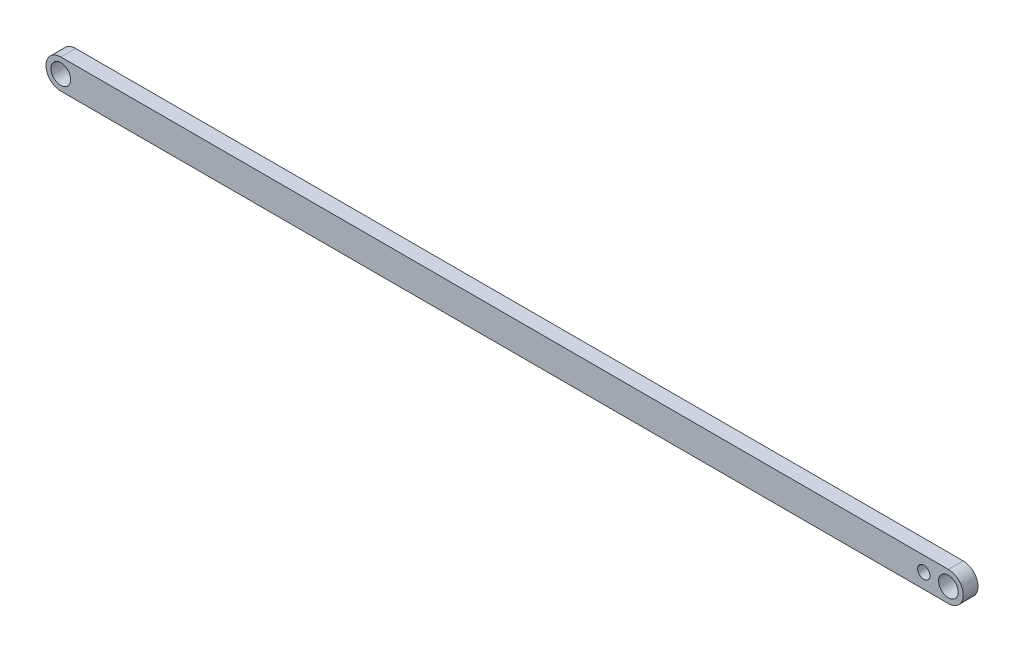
ISO-10303-21;
HEADER;
FILE_DESCRIPTION(('STEP AP214'),'2;1');
FILE_NAME('part.step','',(''),(''),'','','');
FILE_SCHEMA(('AUTOMOTIVE_DESIGN { 1 0 10303 214 1 1 1 1 }'));
ENDSEC;
DATA;
#1=APPLICATION_CONTEXT('core data for automotive mechanical design processes');
#2=APPLICATION_PROTOCOL_DEFINITION('international standard','automotive_design',2000,#1);
#3=PRODUCT_CONTEXT('',#1,'mechanical');
#4=PRODUCT('Part','Part','',(#3));
#5=PRODUCT_RELATED_PRODUCT_CATEGORY('part','',(#4));
#6=PRODUCT_DEFINITION_FORMATION('','',#4);
#7=PRODUCT_DEFINITION_CONTEXT('part definition',#1,'design');
#8=PRODUCT_DEFINITION('design','',#6,#7);
#9=PRODUCT_DEFINITION_SHAPE('','',#8);
#10=(LENGTH_UNIT() NAMED_UNIT(*) SI_UNIT(.MILLI.,.METRE.));
#11=(NAMED_UNIT(*) PLANE_ANGLE_UNIT() SI_UNIT($,.RADIAN.));
#12=(NAMED_UNIT(*) SI_UNIT($,.STERADIAN.) SOLID_ANGLE_UNIT());
#13=UNCERTAINTY_MEASURE_WITH_UNIT(LENGTH_MEASURE(1.E-05),#10,'distance_accuracy_value','');
#14=(GEOMETRIC_REPRESENTATION_CONTEXT(3) GLOBAL_UNCERTAINTY_ASSIGNED_CONTEXT((#13)) GLOBAL_UNIT_ASSIGNED_CONTEXT((#10,
#11,#12)) REPRESENTATION_CONTEXT('',''));
#15=CARTESIAN_POINT('',(0.,0.,0.));
#16=DIRECTION('',(0.,0.,1.));
#17=DIRECTION('',(1.,0.,0.));
#18=AXIS2_PLACEMENT_3D('',#15,#16,#17);
#19=CARTESIAN_POINT('',(0.,30.,30.));
#20=DIRECTION('',(0.,0.,-1.));
#21=DIRECTION('',(-1.,0.,0.));
#22=AXIS2_PLACEMENT_3D('',#19,#20,#21);
#23=PLANE('',#22);
#24=CARTESIAN_POINT('',(1750.,30.,30.));
#25=DIRECTION('',(0.,0.,1.));
#26=DIRECTION('',(1.,0.,0.));
#27=AXIS2_PLACEMENT_3D('',#24,#25,#26);
#28=CIRCLE('',#27,12.5);
#29=CARTESIAN_POINT('',(1762.5,30.,30.));
#30=VERTEX_POINT('',#29);
#31=EDGE_CURVE('E131',#30,#30,#28,.T.);
#32=ORIENTED_EDGE('',*,*,#31,.F.);
#33=EDGE_LOOP('',(#32));
#34=FACE_BOUND('',#33,.T.);
#35=CARTESIAN_POINT('',(0.,30.,30.));
#36=DIRECTION('',(0.,0.,1.));
#37=DIRECTION('',(1.,0.,0.));
#38=AXIS2_PLACEMENT_3D('',#35,#36,#37);
#39=CIRCLE('',#38,20.);
#40=CARTESIAN_POINT('',(20.,30.,30.));
#41=VERTEX_POINT('',#40);
#42=EDGE_CURVE('E92',#41,#41,#39,.T.);
#43=ORIENTED_EDGE('',*,*,#42,.F.);
#44=EDGE_LOOP('',(#43));
#45=FACE_BOUND('',#44,.T.);
#46=CARTESIAN_POINT('',(0.,30.,30.));
#47=DIRECTION('',(0.,0.,1.));
#48=DIRECTION('',(-1.,0.,0.));
#49=AXIS2_PLACEMENT_3D('',#46,#47,#48);
#50=CIRCLE('',#49,30.);
#51=CARTESIAN_POINT('',(0.,60.,30.));
#52=VERTEX_POINT('',#51);
#53=CARTESIAN_POINT('',(0.,0.,30.));
#54=VERTEX_POINT('',#53);
#55=EDGE_CURVE('E102',#52,#54,#50,.T.);
#56=ORIENTED_EDGE('',*,*,#55,.T.);
#57=DIRECTION('',(1.,0.,0.));
#58=VECTOR('',#57,1.);
#59=CARTESIAN_POINT('',(0.,0.,30.));
#60=LINE('',#59,#58);
#61=CARTESIAN_POINT('',(1800.,0.,30.));
#62=VERTEX_POINT('',#61);
#63=EDGE_CURVE('E87',#54,#62,#60,.T.);
#64=ORIENTED_EDGE('',*,*,#63,.T.);
#65=CARTESIAN_POINT('',(1800.,30.,30.));
#66=DIRECTION('',(0.,0.,1.));
#67=DIRECTION('',(-1.,0.,0.));
#68=AXIS2_PLACEMENT_3D('',#65,#66,#67);
#69=CIRCLE('',#68,30.);
#70=CARTESIAN_POINT('',(1800.,60.,30.));
#71=VERTEX_POINT('',#70);
#72=EDGE_CURVE('E53',#62,#71,#69,.T.);
#73=ORIENTED_EDGE('',*,*,#72,.T.);
#74=DIRECTION('',(-1.,0.,0.));
#75=VECTOR('',#74,1.);
#76=CARTESIAN_POINT('',(0.,60.,30.));
#77=LINE('',#76,#75);
#78=EDGE_CURVE('E48',#71,#52,#77,.T.);
#79=ORIENTED_EDGE('',*,*,#78,.T.);
#80=EDGE_LOOP('',(#56,#64,#73,#79));
#81=FACE_BOUND('',#80,.T.);
#82=CARTESIAN_POINT('',(1800.,30.,30.));
#83=DIRECTION('',(0.,0.,1.));
#84=DIRECTION('',(1.,0.,0.));
#85=AXIS2_PLACEMENT_3D('',#82,#83,#84);
#86=CIRCLE('',#85,20.);
#87=CARTESIAN_POINT('',(1820.,30.,30.));
#88=VERTEX_POINT('',#87);
#89=EDGE_CURVE('E120',#88,#88,#86,.T.);
#90=ORIENTED_EDGE('',*,*,#89,.F.);
#91=EDGE_LOOP('',(#90));
#92=FACE_BOUND('',#91,.T.);
#93=ADVANCED_FACE('F33',(#34,#45,#81,#92),#23,.F.);
#94=CARTESIAN_POINT('',(0.,30.,0.));
#95=DIRECTION('',(0.,0.,-1.));
#96=DIRECTION('',(-1.,0.,0.));
#97=AXIS2_PLACEMENT_3D('',#94,#95,#96);
#98=PLANE('',#97);
#99=CARTESIAN_POINT('',(1750.,30.,0.));
#100=DIRECTION('',(0.,0.,1.));
#101=DIRECTION('',(1.,0.,0.));
#102=AXIS2_PLACEMENT_3D('',#99,#100,#101);
#103=CIRCLE('',#102,12.5);
#104=CARTESIAN_POINT('',(1762.5,30.,0.));
#105=VERTEX_POINT('',#104);
#106=EDGE_CURVE('E126',#105,#105,#103,.T.);
#107=ORIENTED_EDGE('',*,*,#106,.T.);
#108=EDGE_LOOP('',(#107));
#109=FACE_BOUND('',#108,.T.);
#110=CARTESIAN_POINT('',(0.,30.,0.));
#111=DIRECTION('',(0.,0.,1.));
#112=DIRECTION('',(1.,0.,0.));
#113=AXIS2_PLACEMENT_3D('',#110,#111,#112);
#114=CIRCLE('',#113,20.);
#115=CARTESIAN_POINT('',(20.,30.,0.));
#116=VERTEX_POINT('',#115);
#117=EDGE_CURVE('E95',#116,#116,#114,.T.);
#118=ORIENTED_EDGE('',*,*,#117,.T.);
#119=EDGE_LOOP('',(#118));
#120=FACE_BOUND('',#119,.T.);
#121=CARTESIAN_POINT('',(0.,30.,0.));
#122=DIRECTION('',(0.,0.,1.));
#123=DIRECTION('',(-1.,0.,0.));
#124=AXIS2_PLACEMENT_3D('',#121,#122,#123);
#125=CIRCLE('',#124,30.);
#126=CARTESIAN_POINT('',(0.,60.,0.));
#127=VERTEX_POINT('',#126);
#128=CARTESIAN_POINT('',(0.,0.,0.));
#129=VERTEX_POINT('',#128);
#130=EDGE_CURVE('E79',#127,#129,#125,.T.);
#131=ORIENTED_EDGE('',*,*,#130,.F.);
#132=DIRECTION('',(-1.,0.,0.));
#133=VECTOR('',#132,1.);
#134=CARTESIAN_POINT('',(0.,60.,0.));
#135=LINE('',#134,#133);
#136=CARTESIAN_POINT('',(1800.,60.,0.));
#137=VERTEX_POINT('',#136);
#138=EDGE_CURVE('E100',#137,#127,#135,.T.);
#139=ORIENTED_EDGE('',*,*,#138,.F.);
#140=CARTESIAN_POINT('',(1800.,30.,0.));
#141=DIRECTION('',(0.,0.,1.));
#142=DIRECTION('',(-1.,0.,0.));
#143=AXIS2_PLACEMENT_3D('',#140,#141,#142);
#144=CIRCLE('',#143,30.);
#145=CARTESIAN_POINT('',(1800.,0.,0.));
#146=VERTEX_POINT('',#145);
#147=EDGE_CURVE('E80',#146,#137,#144,.T.);
#148=ORIENTED_EDGE('',*,*,#147,.F.);
#149=DIRECTION('',(1.,0.,0.));
#150=VECTOR('',#149,1.);
#151=CARTESIAN_POINT('',(0.,0.,0.));
#152=LINE('',#151,#150);
#153=EDGE_CURVE('E74',#129,#146,#152,.T.);
#154=ORIENTED_EDGE('',*,*,#153,.F.);
#155=EDGE_LOOP('',(#131,#139,#148,#154));
#156=FACE_BOUND('',#155,.T.);
#157=CARTESIAN_POINT('',(1800.,30.,0.));
#158=DIRECTION('',(0.,0.,1.));
#159=DIRECTION('',(1.,0.,0.));
#160=AXIS2_PLACEMENT_3D('',#157,#158,#159);
#161=CIRCLE('',#160,20.);
#162=CARTESIAN_POINT('',(1820.,30.,0.));
#163=VERTEX_POINT('',#162);
#164=EDGE_CURVE('E122',#163,#163,#161,.T.);
#165=ORIENTED_EDGE('',*,*,#164,.T.);
#166=EDGE_LOOP('',(#165));
#167=FACE_BOUND('',#166,.T.);
#168=ADVANCED_FACE('F75',(#109,#120,#156,#167),#98,.T.);
#169=CARTESIAN_POINT('',(0.,30.,30.));
#170=DIRECTION('',(0.,0.,-1.));
#171=DIRECTION('',(-1.,0.,0.));
#172=AXIS2_PLACEMENT_3D('',#169,#170,#171);
#173=CYLINDRICAL_SURFACE('',#172,30.);
#174=ORIENTED_EDGE('',*,*,#130,.T.);
#175=DIRECTION('',(0.,0.,-1.));
#176=VECTOR('',#175,1.);
#177=CARTESIAN_POINT('',(0.,0.,30.));
#178=LINE('',#177,#176);
#179=EDGE_CURVE('E11',#54,#129,#178,.T.);
#180=ORIENTED_EDGE('',*,*,#179,.F.);
#181=ORIENTED_EDGE('',*,*,#55,.F.);
#182=DIRECTION('',(0.,0.,-1.));
#183=VECTOR('',#182,1.);
#184=CARTESIAN_POINT('',(0.,60.,30.));
#185=LINE('',#184,#183);
#186=EDGE_CURVE('E91',#52,#127,#185,.T.);
#187=ORIENTED_EDGE('',*,*,#186,.T.);
#188=EDGE_LOOP('',(#174,#180,#181,#187));
#189=FACE_BOUND('',#188,.T.);
#190=ADVANCED_FACE('F35',(#189),#173,.T.);
#191=CARTESIAN_POINT('',(0.,0.,30.));
#192=DIRECTION('',(0.,1.,0.));
#193=DIRECTION('',(0.,0.,1.));
#194=AXIS2_PLACEMENT_3D('',#191,#192,#193);
#195=PLANE('',#194);
#196=ORIENTED_EDGE('',*,*,#153,.T.);
#197=DIRECTION('',(0.,0.,-1.));
#198=VECTOR('',#197,1.);
#199=CARTESIAN_POINT('',(1800.,0.,30.));
#200=LINE('',#199,#198);
#201=EDGE_CURVE('E41',#62,#146,#200,.T.);
#202=ORIENTED_EDGE('',*,*,#201,.F.);
#203=ORIENTED_EDGE('',*,*,#63,.F.);
#204=ORIENTED_EDGE('',*,*,#179,.T.);
#205=EDGE_LOOP('',(#196,#202,#203,#204));
#206=FACE_BOUND('',#205,.T.);
#207=ADVANCED_FACE('F86',(#206),#195,.F.);
#208=CARTESIAN_POINT('',(1800.,30.,30.));
#209=DIRECTION('',(0.,0.,-1.));
#210=DIRECTION('',(-1.,0.,0.));
#211=AXIS2_PLACEMENT_3D('',#208,#209,#210);
#212=CYLINDRICAL_SURFACE('',#211,30.);
#213=ORIENTED_EDGE('',*,*,#147,.T.);
#214=DIRECTION('',(0.,0.,-1.));
#215=VECTOR('',#214,1.);
#216=CARTESIAN_POINT('',(1800.,60.,30.));
#217=LINE('',#216,#215);
#218=EDGE_CURVE('E108',#71,#137,#217,.T.);
#219=ORIENTED_EDGE('',*,*,#218,.F.);
#220=ORIENTED_EDGE('',*,*,#72,.F.);
#221=ORIENTED_EDGE('',*,*,#201,.T.);
#222=EDGE_LOOP('',(#213,#219,#220,#221));
#223=FACE_BOUND('',#222,.T.);
#224=ADVANCED_FACE('F111',(#223),#212,.T.);
#225=CARTESIAN_POINT('',(0.,60.,30.));
#226=DIRECTION('',(0.,-1.,0.));
#227=DIRECTION('',(1.,0.,0.));
#228=AXIS2_PLACEMENT_3D('',#225,#226,#227);
#229=PLANE('',#228);
#230=ORIENTED_EDGE('',*,*,#138,.T.);
#231=ORIENTED_EDGE('',*,*,#186,.F.);
#232=ORIENTED_EDGE('',*,*,#78,.F.);
#233=ORIENTED_EDGE('',*,*,#218,.T.);
#234=EDGE_LOOP('',(#230,#231,#232,#233));
#235=FACE_BOUND('',#234,.T.);
#236=ADVANCED_FACE('F113',(#235),#229,.F.);
#237=CARTESIAN_POINT('',(0.,30.,30.));
#238=DIRECTION('',(0.,0.,-1.));
#239=DIRECTION('',(-1.,0.,0.));
#240=AXIS2_PLACEMENT_3D('',#237,#238,#239);
#241=CYLINDRICAL_SURFACE('',#240,20.);
#242=ORIENTED_EDGE('',*,*,#42,.T.);
#243=EDGE_LOOP('',(#242));
#244=FACE_BOUND('',#243,.T.);
#245=ORIENTED_EDGE('',*,*,#117,.F.);
#246=EDGE_LOOP('',(#245));
#247=FACE_BOUND('',#246,.T.);
#248=ADVANCED_FACE('F139',(#244,#247),#241,.F.);
#249=CARTESIAN_POINT('',(1800.,30.,30.));
#250=DIRECTION('',(0.,0.,-1.));
#251=DIRECTION('',(-1.,0.,0.));
#252=AXIS2_PLACEMENT_3D('',#249,#250,#251);
#253=CYLINDRICAL_SURFACE('',#252,20.);
#254=ORIENTED_EDGE('',*,*,#89,.T.);
#255=EDGE_LOOP('',(#254));
#256=FACE_BOUND('',#255,.T.);
#257=ORIENTED_EDGE('',*,*,#164,.F.);
#258=EDGE_LOOP('',(#257));
#259=FACE_BOUND('',#258,.T.);
#260=ADVANCED_FACE('F142',(#256,#259),#253,.F.);
#261=CARTESIAN_POINT('',(1750.,30.,0.));
#262=DIRECTION('',(0.,0.,1.));
#263=DIRECTION('',(1.,0.,0.));
#264=AXIS2_PLACEMENT_3D('',#261,#262,#263);
#265=CYLINDRICAL_SURFACE('',#264,12.5);
#266=ORIENTED_EDGE('',*,*,#106,.F.);
#267=EDGE_LOOP('',(#266));
#268=FACE_BOUND('',#267,.T.);
#269=ORIENTED_EDGE('',*,*,#31,.T.);
#270=EDGE_LOOP('',(#269));
#271=FACE_BOUND('',#270,.T.);
#272=ADVANCED_FACE('F135',(#268,#271),#265,.F.);
#273=CLOSED_SHELL('',(#93,#168,#190,#207,#224,#236,#248,#260,#272));
#274=MANIFOLD_SOLID_BREP('B2',#273);
#275=ADVANCED_BREP_SHAPE_REPRESENTATION('',(#18,#274),#14);
#276=SHAPE_DEFINITION_REPRESENTATION(#9,#275);
ENDSEC;
END-ISO-10303-21;
